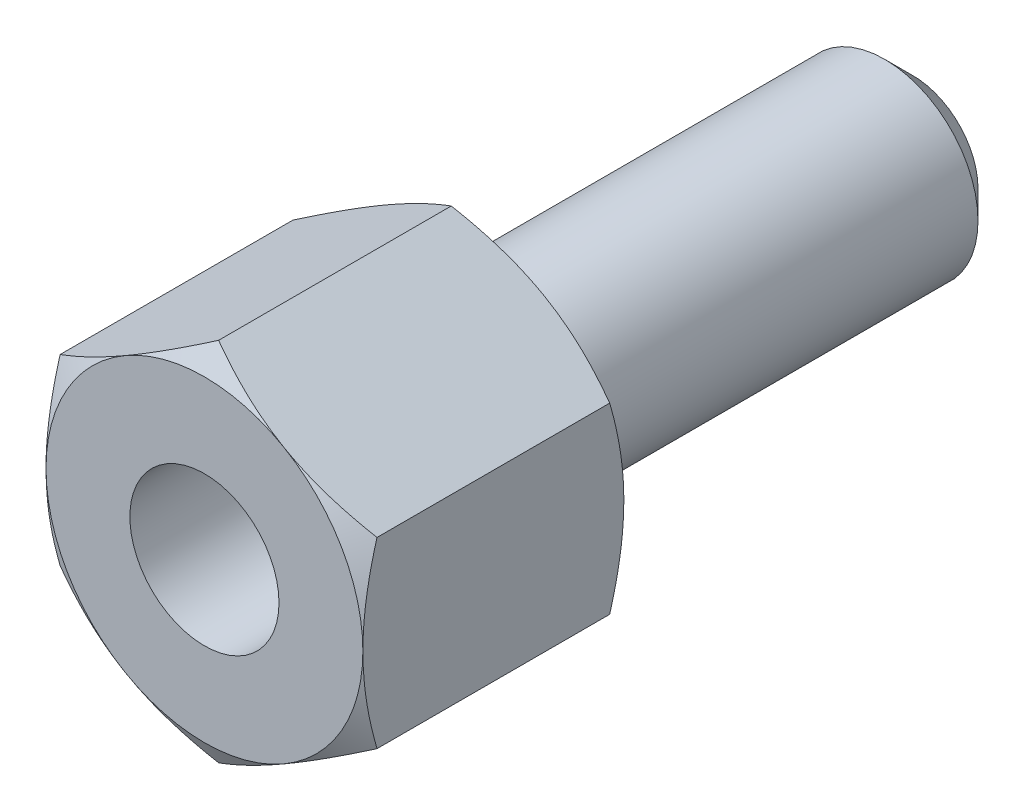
ISO-10303-21;
HEADER;
FILE_DESCRIPTION(('STEP AP214'),'2;1');
FILE_NAME('part.step','',(''),(''),'','','');
FILE_SCHEMA(('AUTOMOTIVE_DESIGN { 1 0 10303 214 1 1 1 1 }'));
ENDSEC;
DATA;
#1=APPLICATION_CONTEXT('core data for automotive mechanical design processes');
#2=APPLICATION_PROTOCOL_DEFINITION('international standard','automotive_design',2000,#1);
#3=PRODUCT_CONTEXT('',#1,'mechanical');
#4=PRODUCT('Part','Part','',(#3));
#5=PRODUCT_RELATED_PRODUCT_CATEGORY('part','',(#4));
#6=PRODUCT_DEFINITION_FORMATION('','',#4);
#7=PRODUCT_DEFINITION_CONTEXT('part definition',#1,'design');
#8=PRODUCT_DEFINITION('design','',#6,#7);
#9=PRODUCT_DEFINITION_SHAPE('','',#8);
#10=(LENGTH_UNIT() NAMED_UNIT(*) SI_UNIT(.MILLI.,.METRE.));
#11=(NAMED_UNIT(*) PLANE_ANGLE_UNIT() SI_UNIT($,.RADIAN.));
#12=(NAMED_UNIT(*) SI_UNIT($,.STERADIAN.) SOLID_ANGLE_UNIT());
#13=UNCERTAINTY_MEASURE_WITH_UNIT(LENGTH_MEASURE(1.E-05),#10,'distance_accuracy_value','');
#14=(GEOMETRIC_REPRESENTATION_CONTEXT(3) GLOBAL_UNCERTAINTY_ASSIGNED_CONTEXT((#13)) GLOBAL_UNIT_ASSIGNED_CONTEXT((#10,
#11,#12)) REPRESENTATION_CONTEXT('',''));
#15=CARTESIAN_POINT('',(0.,0.,0.));
#16=DIRECTION('',(0.,0.,1.));
#17=DIRECTION('',(1.,0.,0.));
#18=AXIS2_PLACEMENT_3D('',#15,#16,#17);
#19=CARTESIAN_POINT('',(8.5,4.90747728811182,14.));
#20=DIRECTION('',(-0.5,-0.866025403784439,0.));
#21=DIRECTION('',(0.866025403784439,-0.5,0.));
#22=AXIS2_PLACEMENT_3D('',#19,#20,#21);
#23=PLANE('',#22);
#24=DIRECTION('',(0.,0.,-1.));
#25=VECTOR('',#24,1.);
#26=CARTESIAN_POINT('',(8.5,4.90747728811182,14.));
#27=LINE('',#26,#25);
#28=CARTESIAN_POINT('',(8.5,4.90747728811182,13.2408106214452));
#29=VERTEX_POINT('',#28);
#30=CARTESIAN_POINT('',(8.5,4.90747728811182,0.75918937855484));
#31=VERTEX_POINT('',#30);
#32=EDGE_CURVE('E337',#29,#31,#27,.T.);
#33=ORIENTED_EDGE('',*,*,#32,.T.);
#34=CARTESIAN_POINT('',(8.5002,4.90736181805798,0.759256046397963));
#35=CARTESIAN_POINT('',(8.31336077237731,5.01523349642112,0.696986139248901));
#36=CARTESIAN_POINT('',(8.12582494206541,5.1235073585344,0.63754229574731));
#37=CARTESIAN_POINT('',(7.74923024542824,5.34093440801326,0.525085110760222));
#38=CARTESIAN_POINT('',(7.56017075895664,5.45008795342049,0.472074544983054));
#39=CARTESIAN_POINT('',(6.9899652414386,5.77929626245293,0.323733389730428));
#40=CARTESIAN_POINT('',(6.60656835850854,6.00065055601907,0.239358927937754));
#41=CARTESIAN_POINT('',(6.03282233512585,6.33190297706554,0.140420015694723));
#42=CARTESIAN_POINT('',(5.84418723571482,6.44081150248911,0.112235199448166));
#43=CARTESIAN_POINT('',(5.4660639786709,6.65912106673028,0.0649740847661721));
#44=CARTESIAN_POINT('',(5.27657589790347,6.76852206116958,0.0458969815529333));
#45=CARTESIAN_POINT('',(4.8972734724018,6.98751241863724,0.0173347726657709));
#46=CARTESIAN_POINT('',(4.70745974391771,7.09710142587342,0.0078387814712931));
#47=CARTESIAN_POINT('',(4.32765694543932,7.31638067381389,-0.00135762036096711));
#48=CARTESIAN_POINT('',(4.13766788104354,7.42607091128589,-0.00105833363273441));
#49=CARTESIAN_POINT('',(3.78247698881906,7.63114046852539,0.00865447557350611));
#50=CARTESIAN_POINT('',(3.6172500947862,7.72653426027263,0.0168831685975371));
#51=CARTESIAN_POINT('',(3.28718328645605,7.9170984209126,0.0405892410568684));
#52=CARTESIAN_POINT('',(3.12234339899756,8.01226877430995,0.0560671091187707));
#53=CARTESIAN_POINT('',(2.62846189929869,8.29741139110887,0.113008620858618));
#54=CARTESIAN_POINT('',(2.30029449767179,8.48687892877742,0.164973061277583));
#55=CARTESIAN_POINT('',(1.64047857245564,8.86782383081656,0.294884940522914));
#56=CARTESIAN_POINT('',(1.30891425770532,9.05925257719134,0.373383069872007));
#57=CARTESIAN_POINT('',(0.650730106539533,9.43925537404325,0.551541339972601));
#58=CARTESIAN_POINT('',(0.324101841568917,9.62783429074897,0.651159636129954));
#59=CARTESIAN_POINT('',(-0.00020000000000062,9.81507004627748,0.759256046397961));
#60=B_SPLINE_CURVE_WITH_KNOTS('',3,(#34,#35,#36,#37,#38,#39,#40,#41,#42,#43,#44,#45,#46,#47,#48,
#49,#50,#51,#52,#53,#54,#55,#56,#57,#58,#59),.UNSPECIFIED.,.F.,.F.,(4,2,2,2,2,2,2,2,2,2,2,2,4),
(0.,0.67359639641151,1.34748239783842,2.69805431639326,3.356799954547,4.01548737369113,
4.67342558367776,5.33134346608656,5.9040955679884,6.47688628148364,7.62328361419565,
8.79510569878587,9.96462743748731),.UNSPECIFIED.);
#61=CARTESIAN_POINT('',(4.25,7.36121593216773,0.));
#62=VERTEX_POINT('',#61);
#63=EDGE_CURVE('E145',#31,#62,#60,.T.);
#64=ORIENTED_EDGE('',*,*,#63,.T.);
#65=CARTESIAN_POINT('',(0.,9.81495457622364,0.75918937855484));
#66=VERTEX_POINT('',#65);
#67=EDGE_CURVE('E114',#62,#66,#60,.T.);
#68=ORIENTED_EDGE('',*,*,#67,.T.);
#69=DIRECTION('',(0.,0.,-1.));
#70=VECTOR('',#69,1.);
#71=CARTESIAN_POINT('',(0.,9.81495457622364,14.));
#72=LINE('',#71,#70);
#73=CARTESIAN_POINT('',(0.,9.81495457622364,13.2408106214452));
#74=VERTEX_POINT('',#73);
#75=EDGE_CURVE('E135',#74,#66,#72,.T.);
#76=ORIENTED_EDGE('',*,*,#75,.F.);
#77=CARTESIAN_POINT('',(-0.000200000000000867,9.81507004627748,13.240743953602));
#78=CARTESIAN_POINT('',(0.186639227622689,9.70719836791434,13.3030138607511));
#79=CARTESIAN_POINT('',(0.374175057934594,9.59892450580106,13.3624577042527));
#80=CARTESIAN_POINT('',(0.75076975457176,9.3814974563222,13.4749148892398));
#81=CARTESIAN_POINT('',(0.939829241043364,9.27234391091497,13.5279254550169));
#82=CARTESIAN_POINT('',(1.51003475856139,8.94313560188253,13.6762666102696));
#83=CARTESIAN_POINT('',(1.89343164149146,8.72178130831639,13.7606410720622));
#84=CARTESIAN_POINT('',(2.46717766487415,8.39052888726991,13.8595799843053));
#85=CARTESIAN_POINT('',(2.65581276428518,8.28162036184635,13.8877648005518));
#86=CARTESIAN_POINT('',(3.0339360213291,8.06331079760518,13.9350259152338));
#87=CARTESIAN_POINT('',(3.22342410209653,7.95390980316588,13.954103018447));
#88=CARTESIAN_POINT('',(3.60272652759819,7.73491944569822,13.9826652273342));
#89=CARTESIAN_POINT('',(3.79254025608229,7.62533043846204,13.9921612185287));
#90=CARTESIAN_POINT('',(4.17234305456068,7.40605119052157,14.0013576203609));
#91=CARTESIAN_POINT('',(4.36233211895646,7.29636095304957,14.0010583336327));
#92=CARTESIAN_POINT('',(4.71752301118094,7.09129139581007,13.9913455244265));
#93=CARTESIAN_POINT('',(4.88274990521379,6.99589760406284,13.9831168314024));
#94=CARTESIAN_POINT('',(5.21281671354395,6.80533344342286,13.9594107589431));
#95=CARTESIAN_POINT('',(5.37765660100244,6.71016309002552,13.9439328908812));
#96=CARTESIAN_POINT('',(5.87153810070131,6.42502047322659,13.8869913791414));
#97=CARTESIAN_POINT('',(6.19970550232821,6.23555293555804,13.8350269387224));
#98=CARTESIAN_POINT('',(6.85952142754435,5.8546080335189,13.7051150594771));
#99=CARTESIAN_POINT('',(7.19108574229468,5.66317928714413,13.626616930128));
#100=CARTESIAN_POINT('',(7.84926989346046,5.28317649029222,13.4484586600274));
#101=CARTESIAN_POINT('',(8.17589815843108,5.09459757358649,13.34884036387));
#102=CARTESIAN_POINT('',(8.5002,4.90736181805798,13.240743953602));
#103=B_SPLINE_CURVE_WITH_KNOTS('',3,(#77,#78,#79,#80,#81,#82,#83,#84,#85,#86,#87,#88,#89,#90,
#91,#92,#93,#94,#95,#96,#97,#98,#99,#100,#101,#102),.UNSPECIFIED.,.F.,.F.,(4,2,2,2,2,2,2,2,2,2,
2,2,4),(0.,0.673596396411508,1.34748239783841,2.69805431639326,3.35679995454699,
4.01548737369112,4.67342558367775,5.33134346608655,5.90409556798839,6.47688628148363,
7.62328361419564,8.79510569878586,9.9646274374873),.UNSPECIFIED.);
#104=CARTESIAN_POINT('',(4.25,7.36121593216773,14.));
#105=VERTEX_POINT('',#104);
#106=EDGE_CURVE('E341',#74,#105,#103,.T.);
#107=ORIENTED_EDGE('',*,*,#106,.T.);
#108=EDGE_CURVE('E255',#105,#29,#103,.T.);
#109=ORIENTED_EDGE('',*,*,#108,.T.);
#110=EDGE_LOOP('',(#33,#64,#68,#76,#107,#109));
#111=FACE_BOUND('',#110,.T.);
#112=ADVANCED_FACE('F14',(#111),#23,.F.);
#113=CARTESIAN_POINT('',(8.5,-4.90747728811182,14.));
#114=DIRECTION('',(-1.,0.,0.));
#115=DIRECTION('',(0.,-1.,0.));
#116=AXIS2_PLACEMENT_3D('',#113,#114,#115);
#117=PLANE('',#116);
#118=DIRECTION('',(0.,0.,-1.));
#119=VECTOR('',#118,1.);
#120=CARTESIAN_POINT('',(8.5,-4.90747728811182,14.));
#121=LINE('',#120,#119);
#122=CARTESIAN_POINT('',(8.5,-4.90747728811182,13.2408106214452));
#123=VERTEX_POINT('',#122);
#124=CARTESIAN_POINT('',(8.5,-4.9074772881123,0.759189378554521));
#125=VERTEX_POINT('',#124);
#126=EDGE_CURVE('E333',#123,#125,#121,.T.);
#127=ORIENTED_EDGE('',*,*,#126,.T.);
#128=CARTESIAN_POINT('',(8.5,-13.354135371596,4.23186863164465));
#129=CARTESIAN_POINT('',(8.5,-12.9814159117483,4.05038124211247));
#130=CARTESIAN_POINT('',(8.5,-12.6078591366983,3.87058490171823));
#131=CARTESIAN_POINT('',(8.5,-11.8586263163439,3.51532203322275));
#132=CARTESIAN_POINT('',(8.5,-11.4829499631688,3.33985615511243));
#133=CARTESIAN_POINT('',(8.5,-10.7271788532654,2.99335554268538));
#134=CARTESIAN_POINT('',(8.5,-10.3470712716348,2.82234868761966));
#135=CARTESIAN_POINT('',(8.5,-9.58389266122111,2.48710662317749));
#136=CARTESIAN_POINT('',(8.5,-9.2008217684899,2.32287110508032));
#137=CARTESIAN_POINT('',(8.5,-8.41807876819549,1.99753861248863));
#138=CARTESIAN_POINT('',(8.5,-8.01828363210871,1.836736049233));
#139=CARTESIAN_POINT('',(8.5,-7.21408086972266,1.52688957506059));
#140=CARTESIAN_POINT('',(8.5,-6.80967274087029,1.37784695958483));
#141=CARTESIAN_POINT('',(8.5,-5.99629875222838,1.09530796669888));
#142=CARTESIAN_POINT('',(8.5,-5.58734344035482,0.961781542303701));
#143=CARTESIAN_POINT('',(8.5,-4.76358283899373,0.714444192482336));
#144=CARTESIAN_POINT('',(8.5,-4.34877938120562,0.600627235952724));
#145=CARTESIAN_POINT('',(8.5,-3.51536652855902,0.398680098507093));
#146=CARTESIAN_POINT('',(8.5,-3.09679350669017,0.310403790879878));
#147=CARTESIAN_POINT('',(8.5,-2.46498813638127,0.200873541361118));
#148=CARTESIAN_POINT('',(8.5,-2.25371438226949,0.168176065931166));
#149=CARTESIAN_POINT('',(8.5,-1.8300592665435,0.111046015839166));
#150=CARTESIAN_POINT('',(8.5,-1.61767801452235,0.0866126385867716));
#151=CARTESIAN_POINT('',(8.5,-1.19494146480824,0.046813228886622));
#152=CARTESIAN_POINT('',(8.5,-0.984597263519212,0.0313298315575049));
#153=CARTESIAN_POINT('',(8.5,-0.563441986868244,0.00927959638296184));
#154=CARTESIAN_POINT('',(8.5,-0.352630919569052,0.00271260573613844));
#155=CARTESIAN_POINT('',(8.5,0.0690799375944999,-0.00134741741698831));
#156=CARTESIAN_POINT('',(8.5,0.279979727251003,0.00115952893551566));
#157=CARTESIAN_POINT('',(8.5,0.70148193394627,0.0151839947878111));
#158=CARTESIAN_POINT('',(8.5,0.912084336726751,0.0267019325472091));
#159=CARTESIAN_POINT('',(8.5,1.41311116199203,0.0645741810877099));
#160=CARTESIAN_POINT('',(8.5,1.70324077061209,0.0949193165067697));
#161=CARTESIAN_POINT('',(8.5,2.28144455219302,0.171093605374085));
#162=CARTESIAN_POINT('',(8.5,2.56951845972,0.216924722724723));
#163=CARTESIAN_POINT('',(8.5,3.43027331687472,0.3752251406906));
#164=CARTESIAN_POINT('',(8.5,3.99918848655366,0.50847582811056));
#165=CARTESIAN_POINT('',(8.5,4.85008763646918,0.740793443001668));
#166=CARTESIAN_POINT('',(8.5,5.13645147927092,0.82475247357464));
#167=CARTESIAN_POINT('',(8.5,5.70640137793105,1.00170549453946));
#168=CARTESIAN_POINT('',(8.5,5.98998741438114,1.09469954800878));
#169=CARTESIAN_POINT('',(8.5,6.55446466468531,1.28820467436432));
#170=CARTESIAN_POINT('',(8.5,6.83535665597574,1.38871350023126));
#171=CARTESIAN_POINT('',(8.5,7.39479262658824,1.59603437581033));
#172=CARTESIAN_POINT('',(8.5,7.67333664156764,1.70284632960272));
#173=CARTESIAN_POINT('',(8.5,8.36027381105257,1.97376772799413));
#174=CARTESIAN_POINT('',(8.5,8.76744306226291,2.14097575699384));
#175=CARTESIAN_POINT('',(8.5,9.57804082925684,2.48425409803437));
#176=CARTESIAN_POINT('',(8.5,9.9814690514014,2.66032509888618));
#177=CARTESIAN_POINT('',(8.5,10.7853317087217,3.01945076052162));
#178=CARTESIAN_POINT('',(8.5,11.1857652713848,3.20250736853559));
#179=CARTESIAN_POINT('',(8.5,11.9840570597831,3.57410887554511));
#180=CARTESIAN_POINT('',(8.5,12.3819153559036,3.76265362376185));
#181=CARTESIAN_POINT('',(8.5,13.1760223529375,4.14439488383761));
#182=CARTESIAN_POINT('',(8.5,13.5722683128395,4.33759708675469));
#183=CARTESIAN_POINT('',(8.5,14.3629923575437,4.72758594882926));
#184=CARTESIAN_POINT('',(8.5,14.7574704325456,4.92437262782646));
#185=CARTESIAN_POINT('',(8.5,15.5448812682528,5.32085324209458));
#186=CARTESIAN_POINT('',(8.5,15.9378142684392,5.52054670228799));
#187=CARTESIAN_POINT('',(8.5,16.7224316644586,5.92237306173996));
#188=CARTESIAN_POINT('',(8.5,17.114116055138,6.12450597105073));
#189=CARTESIAN_POINT('',(8.5,18.2161605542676,6.69685707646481));
#190=CARTESIAN_POINT('',(8.49999999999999,18.9253055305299,7.06941476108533));
#191=CARTESIAN_POINT('',(8.49999999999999,20.340999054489,7.81949456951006));
#192=CARTESIAN_POINT('',(8.49999999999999,21.0475474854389,8.19701691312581));
#193=CARTESIAN_POINT('',(8.49999999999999,22.4565996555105,8.95474143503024));
#194=CARTESIAN_POINT('',(8.49999999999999,23.1591091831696,9.33493285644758));
#195=CARTESIAN_POINT('',(8.49999999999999,24.2116631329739,9.90738965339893));
#196=CARTESIAN_POINT('',(8.49999999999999,24.562301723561,10.0985641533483));
#197=CARTESIAN_POINT('',(8.49999999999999,25.2632232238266,10.4815627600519));
#198=CARTESIAN_POINT('',(8.5,25.6135061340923,10.6733868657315));
#199=CARTESIAN_POINT('',(8.5,25.9636319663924,10.8654973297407));
#200=B_SPLINE_CURVE_WITH_KNOTS('',3,(#128,#129,#130,#131,#132,#133,#134,#135,#136,#137,#138,
#139,#140,#141,#142,#143,#144,#145,#146,#147,#148,#149,#150,#151,#152,#153,#154,#155,#156,#157,
#158,#159,#160,#161,#162,#163,#164,#165,#166,#167,#168,#169,#170,#171,#172,#173,#174,#175,#176,
#177,#178,#179,#180,#181,#182,#183,#184,#185,#186,#187,#188,#189,#190,#191,#192,#193,#194,#195,
#196,#197,#198,#199),.UNSPECIFIED.,.F.,.F.,(4,2,2,2,2,2,2,2,2,2,2,2,2,2,2,2,2,2,2,2,2,2,2,2,2,2,
2,2,2,2,2,2,2,2,2,4),(0.,1.24368523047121,2.48755601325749,3.73791334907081,4.98821361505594,
6.28083538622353,7.57359935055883,8.8638166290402,10.1536384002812,11.4359277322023,
12.0771585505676,12.7183270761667,13.3508849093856,13.9834319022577,14.6159774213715,
15.2485523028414,16.1231982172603,16.9979550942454,18.7483648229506,19.6435398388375,
20.5387211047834,21.4336357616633,22.3285368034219,23.6488857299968,24.9693374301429,
26.2901599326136,27.6109461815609,28.9334375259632,30.255936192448,31.5782210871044,
32.9005114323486,35.3036401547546,37.7068756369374,40.1032356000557,41.3013402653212,
42.4994429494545),.UNSPECIFIED.);
#201=CARTESIAN_POINT('',(8.5,0.,0.));
#202=VERTEX_POINT('',#201);
#203=EDGE_CURVE('E151',#125,#202,#200,.T.);
#204=ORIENTED_EDGE('',*,*,#203,.T.);
#205=EDGE_CURVE('E147',#202,#31,#200,.T.);
#206=ORIENTED_EDGE('',*,*,#205,.T.);
#207=ORIENTED_EDGE('',*,*,#32,.F.);
#208=CARTESIAN_POINT('',(8.5,-13.354135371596,9.76813136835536));
#209=CARTESIAN_POINT('',(8.5,-12.9814159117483,9.94961875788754));
#210=CARTESIAN_POINT('',(8.5,-12.6078591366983,10.1294150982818));
#211=CARTESIAN_POINT('',(8.5,-11.8586263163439,10.4846779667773));
#212=CARTESIAN_POINT('',(8.5,-11.4829499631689,10.6601438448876));
#213=CARTESIAN_POINT('',(8.5,-10.7271788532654,11.0066444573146));
#214=CARTESIAN_POINT('',(8.5,-10.3470712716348,11.1776513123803));
#215=CARTESIAN_POINT('',(8.5,-9.58389266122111,11.5128933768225));
#216=CARTESIAN_POINT('',(8.5,-9.20082176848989,11.6771288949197));
#217=CARTESIAN_POINT('',(8.5,-8.41807876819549,12.0024613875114));
#218=CARTESIAN_POINT('',(8.5,-8.0182836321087,12.163263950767));
#219=CARTESIAN_POINT('',(8.5,-7.21408086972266,12.4731104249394));
#220=CARTESIAN_POINT('',(8.5,-6.80967274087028,12.6221530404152));
#221=CARTESIAN_POINT('',(8.5,-5.99629875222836,12.9046920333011));
#222=CARTESIAN_POINT('',(8.5,-5.5873434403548,13.0382184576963));
#223=CARTESIAN_POINT('',(8.5,-4.76358283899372,13.2855558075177));
#224=CARTESIAN_POINT('',(8.5,-4.34877938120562,13.3993727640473));
#225=CARTESIAN_POINT('',(8.5,-3.51536652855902,13.6013199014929));
#226=CARTESIAN_POINT('',(8.5,-3.09679350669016,13.6895962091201));
#227=CARTESIAN_POINT('',(8.5,-2.46498813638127,13.7991264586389));
#228=CARTESIAN_POINT('',(8.5,-2.25371438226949,13.8318239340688));
#229=CARTESIAN_POINT('',(8.5,-1.8300592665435,13.8889539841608));
#230=CARTESIAN_POINT('',(8.5,-1.61767801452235,13.9133873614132));
#231=CARTESIAN_POINT('',(8.5,-1.19494146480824,13.9531867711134));
#232=CARTESIAN_POINT('',(8.5,-0.984597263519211,13.9686701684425));
#233=CARTESIAN_POINT('',(8.5,-0.563441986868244,13.990720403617));
#234=CARTESIAN_POINT('',(8.5,-0.352630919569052,13.9972873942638));
#235=CARTESIAN_POINT('',(8.5,0.0690799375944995,14.001347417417));
#236=CARTESIAN_POINT('',(8.5,0.279979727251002,13.9988404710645));
#237=CARTESIAN_POINT('',(8.5,0.701481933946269,13.9848160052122));
#238=CARTESIAN_POINT('',(8.5,0.91208433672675,13.9732980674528));
#239=CARTESIAN_POINT('',(8.5,1.41311116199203,13.9354258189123));
#240=CARTESIAN_POINT('',(8.5,1.70324077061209,13.9050806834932));
#241=CARTESIAN_POINT('',(8.5,2.28144455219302,13.8289063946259));
#242=CARTESIAN_POINT('',(8.5,2.56951845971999,13.7830752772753));
#243=CARTESIAN_POINT('',(8.5,3.43027331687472,13.6247748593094));
#244=CARTESIAN_POINT('',(8.5,3.99918848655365,13.4915241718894));
#245=CARTESIAN_POINT('',(8.5,4.85008763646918,13.2592065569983));
#246=CARTESIAN_POINT('',(8.5,5.13645147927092,13.1752475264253));
#247=CARTESIAN_POINT('',(8.5,5.70640137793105,12.9982945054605));
#248=CARTESIAN_POINT('',(8.5,5.98998741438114,12.9053004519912));
#249=CARTESIAN_POINT('',(8.5,6.55446466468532,12.7117953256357));
#250=CARTESIAN_POINT('',(8.5,6.83535665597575,12.6112864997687));
#251=CARTESIAN_POINT('',(8.5,7.39479262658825,12.4039656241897));
#252=CARTESIAN_POINT('',(8.5,7.67333664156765,12.2971536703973));
#253=CARTESIAN_POINT('',(8.5,8.36027381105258,12.0262322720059));
#254=CARTESIAN_POINT('',(8.5,8.76744306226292,11.8590242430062));
#255=CARTESIAN_POINT('',(8.5,9.57804082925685,11.5157459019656));
#256=CARTESIAN_POINT('',(8.5,9.98146905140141,11.3396749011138));
#257=CARTESIAN_POINT('',(8.5,10.7853317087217,10.9805492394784));
#258=CARTESIAN_POINT('',(8.5,11.1857652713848,10.7974926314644));
#259=CARTESIAN_POINT('',(8.5,11.9840570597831,10.4258911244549));
#260=CARTESIAN_POINT('',(8.5,12.3819153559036,10.2373463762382));
#261=CARTESIAN_POINT('',(8.5,13.1760223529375,9.85560511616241));
#262=CARTESIAN_POINT('',(8.5,13.5722683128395,9.66240291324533));
#263=CARTESIAN_POINT('',(8.5,14.3629923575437,9.27241405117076));
#264=CARTESIAN_POINT('',(8.5,14.7574704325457,9.07562737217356));
#265=CARTESIAN_POINT('',(8.5,15.5448812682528,8.67914675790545));
#266=CARTESIAN_POINT('',(8.5,15.9378142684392,8.47945329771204));
#267=CARTESIAN_POINT('',(8.5,16.7224316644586,8.07762693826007));
#268=CARTESIAN_POINT('',(8.5,17.114116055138,7.87549402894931));
#269=CARTESIAN_POINT('',(8.5,18.2161605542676,7.30314292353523));
#270=CARTESIAN_POINT('',(8.49999999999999,18.92530553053,6.93058523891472));
#271=CARTESIAN_POINT('',(8.49999999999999,20.340999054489,6.18050543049));
#272=CARTESIAN_POINT('',(8.49999999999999,21.0475474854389,5.80298308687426));
#273=CARTESIAN_POINT('',(8.49999999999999,22.4565996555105,5.04525856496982));
#274=CARTESIAN_POINT('',(8.49999999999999,23.1591091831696,4.66506714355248));
#275=CARTESIAN_POINT('',(8.49999999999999,24.2116631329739,4.09261034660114));
#276=CARTESIAN_POINT('',(8.49999999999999,24.562301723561,3.90143584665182));
#277=CARTESIAN_POINT('',(8.49999999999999,25.2632232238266,3.51843723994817));
#278=CARTESIAN_POINT('',(8.5,25.6135061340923,3.32661313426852));
#279=CARTESIAN_POINT('',(8.5,25.9636319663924,3.13450267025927));
#280=B_SPLINE_CURVE_WITH_KNOTS('',3,(#208,#209,#210,#211,#212,#213,#214,#215,#216,#217,#218,
#219,#220,#221,#222,#223,#224,#225,#226,#227,#228,#229,#230,#231,#232,#233,#234,#235,#236,#237,
#238,#239,#240,#241,#242,#243,#244,#245,#246,#247,#248,#249,#250,#251,#252,#253,#254,#255,#256,
#257,#258,#259,#260,#261,#262,#263,#264,#265,#266,#267,#268,#269,#270,#271,#272,#273,#274,#275,
#276,#277,#278,#279),.UNSPECIFIED.,.F.,.F.,(4,2,2,2,2,2,2,2,2,2,2,2,2,2,2,2,2,2,2,2,2,2,2,2,2,2,
2,2,2,2,2,2,2,2,2,4),(0.,1.24368523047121,2.48755601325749,3.73791334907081,4.98821361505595,
6.28083538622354,7.57359935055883,8.8638166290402,10.1536384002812,11.4359277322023,
12.0771585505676,12.7183270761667,13.3508849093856,13.9834319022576,14.6159774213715,
15.2485523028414,16.1231982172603,16.9979550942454,18.7483648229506,19.6435398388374,
20.5387211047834,21.4336357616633,22.3285368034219,23.6488857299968,24.9693374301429,
26.2901599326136,27.6109461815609,28.9334375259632,30.255936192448,31.5782210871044,
32.9005114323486,35.3036401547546,37.7068756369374,40.1032356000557,41.3013402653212,
42.4994429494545),.UNSPECIFIED.);
#281=CARTESIAN_POINT('',(8.5,0.,14.));
#282=VERTEX_POINT('',#281);
#283=EDGE_CURVE('E254',#29,#282,#280,.F.);
#284=ORIENTED_EDGE('',*,*,#283,.T.);
#285=EDGE_CURVE('E247',#282,#123,#280,.F.);
#286=ORIENTED_EDGE('',*,*,#285,.T.);
#287=EDGE_LOOP('',(#127,#204,#206,#207,#284,#286));
#288=FACE_BOUND('',#287,.T.);
#289=ADVANCED_FACE('F261',(#288),#117,.F.);
#290=CARTESIAN_POINT('',(0.,-9.81495457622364,14.));
#291=DIRECTION('',(-0.5,0.866025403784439,0.));
#292=DIRECTION('',(-0.866025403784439,-0.5,0.));
#293=AXIS2_PLACEMENT_3D('',#290,#291,#292);
#294=PLANE('',#293);
#295=DIRECTION('',(0.,0.,-1.));
#296=VECTOR('',#295,1.);
#297=CARTESIAN_POINT('',(0.,-9.81495457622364,14.));
#298=LINE('',#297,#296);
#299=CARTESIAN_POINT('',(0.,-9.81495457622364,13.2408106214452));
#300=VERTEX_POINT('',#299);
#301=CARTESIAN_POINT('',(0.,-9.81495457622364,0.759189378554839));
#302=VERTEX_POINT('',#301);
#303=EDGE_CURVE('E169',#300,#302,#298,.T.);
#304=ORIENTED_EDGE('',*,*,#303,.T.);
#305=CARTESIAN_POINT('',(-0.000200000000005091,-9.81507004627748,0.759256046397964));
#306=CARTESIAN_POINT('',(0.186639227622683,-9.70719836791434,0.696986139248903));
#307=CARTESIAN_POINT('',(0.374175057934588,-9.59892450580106,0.637542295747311));
#308=CARTESIAN_POINT('',(0.750769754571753,-9.38149745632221,0.525085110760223));
#309=CARTESIAN_POINT('',(0.939829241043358,-9.27234391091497,0.472074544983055));
#310=CARTESIAN_POINT('',(1.51003475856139,-8.94313560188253,0.323733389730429));
#311=CARTESIAN_POINT('',(1.89343164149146,-8.72178130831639,0.239358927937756));
#312=CARTESIAN_POINT('',(2.46717766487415,-8.39052888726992,0.140420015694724));
#313=CARTESIAN_POINT('',(2.65581276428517,-8.28162036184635,0.112235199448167));
#314=CARTESIAN_POINT('',(3.0339360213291,-8.06331079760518,0.0649740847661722));
#315=CARTESIAN_POINT('',(3.22342410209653,-7.95390980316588,0.0458969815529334));
#316=CARTESIAN_POINT('',(3.60272652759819,-7.73491944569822,0.0173347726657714));
#317=CARTESIAN_POINT('',(3.79254025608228,-7.62533043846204,0.00783878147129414));
#318=CARTESIAN_POINT('',(4.17234305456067,-7.40605119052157,-0.00135762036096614));
#319=CARTESIAN_POINT('',(4.36233211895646,-7.29636095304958,-0.00105833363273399));
#320=CARTESIAN_POINT('',(4.71752301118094,-7.09129139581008,0.00865447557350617));
#321=CARTESIAN_POINT('',(4.88274990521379,-6.99589760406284,0.0168831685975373));
#322=CARTESIAN_POINT('',(5.21281671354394,-6.80533344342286,0.0405892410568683));
#323=CARTESIAN_POINT('',(5.37765660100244,-6.71016309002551,0.0560671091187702));
#324=CARTESIAN_POINT('',(5.87153810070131,-6.4250204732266,0.113008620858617));
#325=CARTESIAN_POINT('',(6.19970550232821,-6.23555293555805,0.164973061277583));
#326=CARTESIAN_POINT('',(6.85952142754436,-5.8546080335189,0.294884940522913));
#327=CARTESIAN_POINT('',(7.19108574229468,-5.66317928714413,0.373383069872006));
#328=CARTESIAN_POINT('',(7.84926989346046,-5.28317649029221,0.5515413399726));
#329=CARTESIAN_POINT('',(8.17589815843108,-5.09459757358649,0.651159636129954));
#330=CARTESIAN_POINT('',(8.5002,-4.90736181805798,0.759256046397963));
#331=B_SPLINE_CURVE_WITH_KNOTS('',3,(#305,#306,#307,#308,#309,#310,#311,#312,#313,#314,#315,
#316,#317,#318,#319,#320,#321,#322,#323,#324,#325,#326,#327,#328,#329,#330),.UNSPECIFIED.,.F.,
.F.,(4,2,2,2,2,2,2,2,2,2,2,2,4),(0.,0.67359639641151,1.34748239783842,2.69805431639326,
3.356799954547,4.01548737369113,4.67342558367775,5.33134346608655,5.9040955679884,
6.47688628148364,7.62328361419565,8.79510569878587,9.96462743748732),.UNSPECIFIED.);
#332=CARTESIAN_POINT('',(4.25,-7.36121593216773,0.));
#333=VERTEX_POINT('',#332);
#334=EDGE_CURVE('E162',#302,#333,#331,.T.);
#335=ORIENTED_EDGE('',*,*,#334,.T.);
#336=EDGE_CURVE('E157',#333,#125,#331,.T.);
#337=ORIENTED_EDGE('',*,*,#336,.T.);
#338=ORIENTED_EDGE('',*,*,#126,.F.);
#339=CARTESIAN_POINT('',(8.5002,-4.90736181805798,13.240743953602));
#340=CARTESIAN_POINT('',(8.31336077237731,-5.01523349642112,13.3030138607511));
#341=CARTESIAN_POINT('',(8.1258249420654,-5.1235073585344,13.3624577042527));
#342=CARTESIAN_POINT('',(7.74923024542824,-5.34093440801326,13.4749148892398));
#343=CARTESIAN_POINT('',(7.56017075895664,-5.45008795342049,13.5279254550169));
#344=CARTESIAN_POINT('',(6.98996524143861,-5.77929626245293,13.6762666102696));
#345=CARTESIAN_POINT('',(6.60656835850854,-6.00065055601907,13.7606410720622));
#346=CARTESIAN_POINT('',(6.03282233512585,-6.33190297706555,13.8595799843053));
#347=CARTESIAN_POINT('',(5.84418723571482,-6.44081150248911,13.8877648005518));
#348=CARTESIAN_POINT('',(5.4660639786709,-6.65912106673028,13.9350259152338));
#349=CARTESIAN_POINT('',(5.27657589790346,-6.76852206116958,13.954103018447));
#350=CARTESIAN_POINT('',(4.8972734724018,-6.98751241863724,13.9826652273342));
#351=CARTESIAN_POINT('',(4.70745974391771,-7.09710142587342,13.9921612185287));
#352=CARTESIAN_POINT('',(4.32765694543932,-7.31638067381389,14.0013576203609));
#353=CARTESIAN_POINT('',(4.13766788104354,-7.42607091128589,14.0010583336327));
#354=CARTESIAN_POINT('',(3.78247698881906,-7.63114046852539,13.9913455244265));
#355=CARTESIAN_POINT('',(3.61725009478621,-7.72653426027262,13.9831168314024));
#356=CARTESIAN_POINT('',(3.28718328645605,-7.9170984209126,13.9594107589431));
#357=CARTESIAN_POINT('',(3.12234339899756,-8.01226877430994,13.9439328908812));
#358=CARTESIAN_POINT('',(2.62846189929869,-8.29741139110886,13.8869913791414));
#359=CARTESIAN_POINT('',(2.30029449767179,-8.48687892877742,13.8350269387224));
#360=CARTESIAN_POINT('',(1.64047857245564,-8.86782383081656,13.7051150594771));
#361=CARTESIAN_POINT('',(1.30891425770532,-9.05925257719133,13.626616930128));
#362=CARTESIAN_POINT('',(0.650730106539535,-9.43925537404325,13.4484586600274));
#363=CARTESIAN_POINT('',(0.324101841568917,-9.62783429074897,13.34884036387));
#364=CARTESIAN_POINT('',(-0.000200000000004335,-9.81507004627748,13.240743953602));
#365=B_SPLINE_CURVE_WITH_KNOTS('',3,(#339,#340,#341,#342,#343,#344,#345,#346,#347,#348,#349,
#350,#351,#352,#353,#354,#355,#356,#357,#358,#359,#360,#361,#362,#363,#364),.UNSPECIFIED.,.F.,
.F.,(4,2,2,2,2,2,2,2,2,2,2,2,4),(0.,0.673596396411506,1.34748239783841,2.69805431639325,
3.35679995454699,4.01548737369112,4.67342558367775,5.33134346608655,5.90409556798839,
6.47688628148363,7.62328361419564,8.79510569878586,9.9646274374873),.UNSPECIFIED.);
#366=CARTESIAN_POINT('',(4.25,-7.36121593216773,14.));
#367=VERTEX_POINT('',#366);
#368=EDGE_CURVE('E246',#123,#367,#365,.T.);
#369=ORIENTED_EDGE('',*,*,#368,.T.);
#370=EDGE_CURVE('E240',#367,#300,#365,.T.);
#371=ORIENTED_EDGE('',*,*,#370,.T.);
#372=EDGE_LOOP('',(#304,#335,#337,#338,#369,#371));
#373=FACE_BOUND('',#372,.T.);
#374=ADVANCED_FACE('F166',(#373),#294,.F.);
#375=CARTESIAN_POINT('',(-8.5,-4.90747728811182,14.));
#376=DIRECTION('',(0.5,0.866025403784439,0.));
#377=DIRECTION('',(-0.866025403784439,0.5,0.));
#378=AXIS2_PLACEMENT_3D('',#375,#376,#377);
#379=PLANE('',#378);
#380=DIRECTION('',(0.,0.,-1.));
#381=VECTOR('',#380,1.);
#382=CARTESIAN_POINT('',(-8.5,-4.90747728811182,14.));
#383=LINE('',#382,#381);
#384=CARTESIAN_POINT('',(-8.5,-4.9074772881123,13.2408106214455));
#385=VERTEX_POINT('',#384);
#386=CARTESIAN_POINT('',(-8.5,-4.9074772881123,0.759189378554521));
#387=VERTEX_POINT('',#386);
#388=EDGE_CURVE('E319',#385,#387,#383,.T.);
#389=ORIENTED_EDGE('',*,*,#388,.T.);
#390=CARTESIAN_POINT('',(-8.5002,-4.90736181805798,0.759256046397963));
#391=CARTESIAN_POINT('',(-8.31336077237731,-5.01523349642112,0.696986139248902));
#392=CARTESIAN_POINT('',(-8.12582494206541,-5.1235073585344,0.63754229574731));
#393=CARTESIAN_POINT('',(-7.74923024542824,-5.34093440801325,0.525085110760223));
#394=CARTESIAN_POINT('',(-7.56017075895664,-5.45008795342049,0.472074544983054));
#395=CARTESIAN_POINT('',(-6.98996524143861,-5.77929626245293,0.323733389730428));
#396=CARTESIAN_POINT('',(-6.60656835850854,-6.00065055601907,0.239358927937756));
#397=CARTESIAN_POINT('',(-6.03282233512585,-6.33190297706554,0.140420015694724));
#398=CARTESIAN_POINT('',(-5.84418723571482,-6.44081150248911,0.112235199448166));
#399=CARTESIAN_POINT('',(-5.4660639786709,-6.65912106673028,0.064974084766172));
#400=CARTESIAN_POINT('',(-5.27657589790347,-6.76852206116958,0.0458969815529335));
#401=CARTESIAN_POINT('',(-4.8972734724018,-6.98751241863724,0.017334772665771));
#402=CARTESIAN_POINT('',(-4.70745974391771,-7.09710142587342,0.00783878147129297));
#403=CARTESIAN_POINT('',(-4.32765694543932,-7.31638067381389,-0.00135762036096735));
#404=CARTESIAN_POINT('',(-4.13766788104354,-7.42607091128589,-0.00105833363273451));
#405=CARTESIAN_POINT('',(-3.78247698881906,-7.63114046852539,0.00865447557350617));
#406=CARTESIAN_POINT('',(-3.6172500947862,-7.72653426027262,0.0168831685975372));
#407=CARTESIAN_POINT('',(-3.28718328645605,-7.9170984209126,0.0405892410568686));
#408=CARTESIAN_POINT('',(-3.12234339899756,-8.01226877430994,0.0560671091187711));
#409=CARTESIAN_POINT('',(-2.62846189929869,-8.29741139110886,0.113008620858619));
#410=CARTESIAN_POINT('',(-2.30029449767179,-8.48687892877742,0.164973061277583));
#411=CARTESIAN_POINT('',(-1.64047857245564,-8.86782383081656,0.294884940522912));
#412=CARTESIAN_POINT('',(-1.30891425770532,-9.05925257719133,0.373383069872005));
#413=CARTESIAN_POINT('',(-0.65073010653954,-9.43925537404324,0.551541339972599));
#414=CARTESIAN_POINT('',(-0.324101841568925,-9.62783429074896,0.651159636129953));
#415=CARTESIAN_POINT('',(0.000199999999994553,-9.81507004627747,0.759256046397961));
#416=B_SPLINE_CURVE_WITH_KNOTS('',3,(#390,#391,#392,#393,#394,#395,#396,#397,#398,#399,#400,
#401,#402,#403,#404,#405,#406,#407,#408,#409,#410,#411,#412,#413,#414,#415),.UNSPECIFIED.,.F.,
.F.,(4,2,2,2,2,2,2,2,2,2,2,2,4),(0.,0.67359639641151,1.34748239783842,2.69805431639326,
3.356799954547,4.01548737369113,4.67342558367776,5.33134346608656,5.9040955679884,
6.47688628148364,7.62328361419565,8.79510569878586,9.9646274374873),.UNSPECIFIED.);
#417=CARTESIAN_POINT('',(-4.25,-7.36121593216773,0.));
#418=VERTEX_POINT('',#417);
#419=EDGE_CURVE('E152',#387,#418,#416,.T.);
#420=ORIENTED_EDGE('',*,*,#419,.T.);
#421=EDGE_CURVE('E163',#418,#302,#416,.T.);
#422=ORIENTED_EDGE('',*,*,#421,.T.);
#423=ORIENTED_EDGE('',*,*,#303,.F.);
#424=CARTESIAN_POINT('',(0.000199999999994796,-9.81507004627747,13.240743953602));
#425=CARTESIAN_POINT('',(-0.186639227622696,-9.70719836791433,13.3030138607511));
#426=CARTESIAN_POINT('',(-0.374175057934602,-9.59892450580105,13.3624577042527));
#427=CARTESIAN_POINT('',(-0.750769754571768,-9.3814974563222,13.4749148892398));
#428=CARTESIAN_POINT('',(-0.939829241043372,-9.27234391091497,13.5279254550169));
#429=CARTESIAN_POINT('',(-1.5100347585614,-8.94313560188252,13.6762666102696));
#430=CARTESIAN_POINT('',(-1.89343164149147,-8.72178130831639,13.7606410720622));
#431=CARTESIAN_POINT('',(-2.46717766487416,-8.39052888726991,13.8595799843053));
#432=CARTESIAN_POINT('',(-2.65581276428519,-8.28162036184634,13.8877648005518));
#433=CARTESIAN_POINT('',(-3.03393602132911,-8.06331079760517,13.9350259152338));
#434=CARTESIAN_POINT('',(-3.22342410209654,-7.95390980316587,13.954103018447));
#435=CARTESIAN_POINT('',(-3.6027265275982,-7.73491944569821,13.9826652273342));
#436=CARTESIAN_POINT('',(-3.79254025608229,-7.62533043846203,13.9921612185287));
#437=CARTESIAN_POINT('',(-4.17234305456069,-7.40605119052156,14.0013576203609));
#438=CARTESIAN_POINT('',(-4.36233211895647,-7.29636095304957,14.0010583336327));
#439=CARTESIAN_POINT('',(-4.71752301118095,-7.09129139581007,13.9913455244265));
#440=CARTESIAN_POINT('',(-4.8827499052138,-6.99589760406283,13.9831168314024));
#441=CARTESIAN_POINT('',(-5.21281671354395,-6.80533344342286,13.9594107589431));
#442=CARTESIAN_POINT('',(-5.37765660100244,-6.71016309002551,13.9439328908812));
#443=CARTESIAN_POINT('',(-5.87153810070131,-6.42502047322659,13.8869913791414));
#444=CARTESIAN_POINT('',(-6.19970550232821,-6.23555293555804,13.8350269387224));
#445=CARTESIAN_POINT('',(-6.85952142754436,-5.8546080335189,13.7051150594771));
#446=CARTESIAN_POINT('',(-7.19108574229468,-5.66317928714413,13.626616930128));
#447=CARTESIAN_POINT('',(-7.84926989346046,-5.28317649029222,13.4484586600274));
#448=CARTESIAN_POINT('',(-8.17589815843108,-5.09459757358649,13.34884036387));
#449=CARTESIAN_POINT('',(-8.5002,-4.90736181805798,13.240743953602));
#450=B_SPLINE_CURVE_WITH_KNOTS('',3,(#424,#425,#426,#427,#428,#429,#430,#431,#432,#433,#434,
#435,#436,#437,#438,#439,#440,#441,#442,#443,#444,#445,#446,#447,#448,#449),.UNSPECIFIED.,.F.,
.F.,(4,2,2,2,2,2,2,2,2,2,2,2,4),(0.,0.673596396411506,1.34748239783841,2.69805431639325,
3.35679995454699,4.01548737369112,4.67342558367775,5.33134346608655,5.90409556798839,
6.47688628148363,7.62328361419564,8.79510569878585,9.96462743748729),.UNSPECIFIED.);
#451=CARTESIAN_POINT('',(-4.25,-7.36121593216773,14.));
#452=VERTEX_POINT('',#451);
#453=EDGE_CURVE('E233',#300,#452,#450,.T.);
#454=ORIENTED_EDGE('',*,*,#453,.T.);
#455=EDGE_CURVE('E225',#452,#385,#450,.T.);
#456=ORIENTED_EDGE('',*,*,#455,.T.);
#457=EDGE_LOOP('',(#389,#420,#422,#423,#454,#456));
#458=FACE_BOUND('',#457,.T.);
#459=ADVANCED_FACE('F217',(#458),#379,.F.);
#460=CARTESIAN_POINT('',(-8.5,4.90747728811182,14.));
#461=DIRECTION('',(1.,0.,0.));
#462=DIRECTION('',(0.,0.,-1.));
#463=AXIS2_PLACEMENT_3D('',#460,#461,#462);
#464=PLANE('',#463);
#465=DIRECTION('',(0.,0.,-1.));
#466=VECTOR('',#465,1.);
#467=CARTESIAN_POINT('',(-8.5,4.90747728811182,14.));
#468=LINE('',#467,#466);
#469=CARTESIAN_POINT('',(-8.5,4.90747728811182,13.2408106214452));
#470=VERTEX_POINT('',#469);
#471=CARTESIAN_POINT('',(-8.5,4.90747728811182,0.75918937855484));
#472=VERTEX_POINT('',#471);
#473=EDGE_CURVE('E357',#470,#472,#468,.T.);
#474=ORIENTED_EDGE('',*,*,#473,.T.);
#475=CARTESIAN_POINT('',(-8.5,-13.3541353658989,4.23186862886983));
#476=CARTESIAN_POINT('',(-8.5,-12.9814159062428,4.05038123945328));
#477=CARTESIAN_POINT('',(-8.5,-12.6078591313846,3.8705848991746));
#478=CARTESIAN_POINT('',(-8.5,-11.8586263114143,3.51532203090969));
#479=CARTESIAN_POINT('',(-8.5,-11.4829499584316,3.33985615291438));
#480=CARTESIAN_POINT('',(-8.5,-10.7271788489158,2.99335554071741));
#481=CARTESIAN_POINT('',(-8.5,-10.3470712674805,2.82234868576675));
#482=CARTESIAN_POINT('',(-8.5,-9.58389265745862,2.48710662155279));
#483=CARTESIAN_POINT('',(-8.5,-9.20082176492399,2.32287110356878));
#484=CARTESIAN_POINT('',(-8.5,-8.41807876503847,1.99753861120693));
#485=CARTESIAN_POINT('',(-8.5,-8.01828362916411,1.83673604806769));
#486=CARTESIAN_POINT('',(-8.5,-7.21408086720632,1.5268895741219));
#487=CARTESIAN_POINT('',(-8.5,-6.80967273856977,1.37784695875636));
#488=CARTESIAN_POINT('',(-8.5,-5.99629875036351,1.09530796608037));
#489=CARTESIAN_POINT('',(-8.5,-5.58734343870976,0.961781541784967));
#490=CARTESIAN_POINT('',(-8.5,-4.76358283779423,0.714444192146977));
#491=CARTESIAN_POINT('',(-8.5,-4.34877938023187,0.600627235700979));
#492=CARTESIAN_POINT('',(-8.5,-3.5153665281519,0.398680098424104));
#493=CARTESIAN_POINT('',(-8.5,-3.09679350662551,0.31040379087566));
#494=CARTESIAN_POINT('',(-8.5,-2.46498813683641,0.200873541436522));
#495=CARTESIAN_POINT('',(-8.5,-2.25371438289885,0.168176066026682));
#496=CARTESIAN_POINT('',(-8.5,-1.83005926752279,0.111046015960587));
#497=CARTESIAN_POINT('',(-8.5,-1.61767801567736,0.0866126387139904));
#498=CARTESIAN_POINT('',(-8.5,-1.19494146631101,0.0468132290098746));
#499=CARTESIAN_POINT('',(-8.5,-0.984597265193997,0.0313298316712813));
#500=CARTESIAN_POINT('',(-8.5,-0.563441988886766,0.00927959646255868));
#501=CARTESIAN_POINT('',(-8.5,-0.352630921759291,0.00271260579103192));
#502=CARTESIAN_POINT('',(-8.5,0.0690799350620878,-0.00134741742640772));
#503=CARTESIAN_POINT('',(-8.5,0.279979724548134,0.00115952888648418));
#504=CARTESIAN_POINT('',(-8.5,0.701481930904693,0.0151839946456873));
#505=CARTESIAN_POINT('',(-8.5,0.912084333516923,0.0267019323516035));
#506=CARTESIAN_POINT('',(-8.5,1.41311115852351,0.0645741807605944));
#507=CARTESIAN_POINT('',(-8.5,1.70324076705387,0.0949193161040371));
#508=CARTESIAN_POINT('',(-8.5,2.28144454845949,0.171093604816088));
#509=CARTESIAN_POINT('',(-8.5,2.56951845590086,0.216924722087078));
#510=CARTESIAN_POINT('',(-8.5,3.43027331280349,0.375225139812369));
#511=CARTESIAN_POINT('',(-8.5,3.99918848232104,0.508475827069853));
#512=CARTESIAN_POINT('',(-8.5,4.85008763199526,0.740793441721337));
#513=CARTESIAN_POINT('',(-8.5,5.13645147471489,0.824752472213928));
#514=CARTESIAN_POINT('',(-8.5,5.70640137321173,1.00170549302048));
#515=CARTESIAN_POINT('',(-8.5,5.98998740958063,1.0946995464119));
#516=CARTESIAN_POINT('',(-8.5,6.55446465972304,1.28820467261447));
#517=CARTESIAN_POINT('',(-8.5,6.8353566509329,1.38871349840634));
#518=CARTESIAN_POINT('',(-8.5,7.39479262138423,1.59603437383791));
#519=CARTESIAN_POINT('',(-8.5,7.67333663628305,1.70284632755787));
#520=CARTESIAN_POINT('',(-8.5,8.36027380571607,1.97376772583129));
#521=CARTESIAN_POINT('',(-8.5,8.76744305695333,2.140975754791));
#522=CARTESIAN_POINT('',(-8.5,9.57804082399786,2.4842540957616));
#523=CARTESIAN_POINT('',(-8.5,9.98146904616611,2.66032509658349));
#524=CARTESIAN_POINT('',(-8.5,10.7853317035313,3.01945075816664));
#525=CARTESIAN_POINT('',(-8.5,11.1857652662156,3.20250736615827));
#526=CARTESIAN_POINT('',(-8.5,11.9840570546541,3.5741088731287));
#527=CARTESIAN_POINT('',(-8.5,12.3819153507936,3.76265362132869));
#528=CARTESIAN_POINT('',(-8.5,13.1760223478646,4.14439488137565));
#529=CARTESIAN_POINT('',(-8.5,13.5722683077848,4.33759708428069));
#530=CARTESIAN_POINT('',(-8.5,14.3629923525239,4.72758594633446));
#531=CARTESIAN_POINT('',(-8.5,14.7574704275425,4.9243726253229));
#532=CARTESIAN_POINT('',(-8.5,15.5448812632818,5.32085323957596));
#533=CARTESIAN_POINT('',(-8.5,15.9378142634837,5.52054669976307));
#534=CARTESIAN_POINT('',(-8.5,16.7224316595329,5.92237305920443));
#535=CARTESIAN_POINT('',(-8.5,17.1141160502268,6.12450596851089));
#536=CARTESIAN_POINT('',(-8.5,18.2161605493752,6.6968570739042));
#537=CARTESIAN_POINT('',(-8.5,18.9253055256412,7.06941475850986));
#538=CARTESIAN_POINT('',(-8.5,20.3409990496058,7.81949456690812));
#539=CARTESIAN_POINT('',(-8.5,21.0475474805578,8.19701691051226));
#540=CARTESIAN_POINT('',(-8.5,22.4565996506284,8.95474143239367));
#541=CARTESIAN_POINT('',(-8.5,23.1591091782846,9.33493285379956));
#542=CARTESIAN_POINT('',(-8.5,24.2116631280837,9.9073896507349));
#543=CARTESIAN_POINT('',(-8.5,24.562301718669,10.0985641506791));
#544=CARTESIAN_POINT('',(-8.5,25.2632232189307,10.4815627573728));
#545=CARTESIAN_POINT('',(-8.5,25.6135061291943,10.6733868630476));
#546=CARTESIAN_POINT('',(-8.5,25.9636319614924,10.8654973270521));
#547=B_SPLINE_CURVE_WITH_KNOTS('',3,(#475,#476,#477,#478,#479,#480,#481,#482,#483,#484,#485,
#486,#487,#488,#489,#490,#491,#492,#493,#494,#495,#496,#497,#498,#499,#500,#501,#502,#503,#504,
#505,#506,#507,#508,#509,#510,#511,#512,#513,#514,#515,#516,#517,#518,#519,#520,#521,#522,#523,
#524,#525,#526,#527,#528,#529,#530,#531,#532,#533,#534,#535,#536,#537,#538,#539,#540,#541,#542,
#543,#544,#545,#546),.UNSPECIFIED.,.F.,.F.,(4,2,2,2,2,2,2,2,2,2,2,2,2,2,2,2,2,2,2,2,2,2,2,2,2,2,
2,2,2,2,2,2,2,2,2,4),(0.,1.24368522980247,2.48755601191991,3.73791334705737,4.98821361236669,
6.28083538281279,7.57359934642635,8.86381662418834,10.1536383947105,11.4359277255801,
12.07715854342,12.7183270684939,13.3508849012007,13.9834318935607,14.6159774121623,
15.2485522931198,16.1231982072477,16.9979550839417,18.7483648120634,19.6435398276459,
20.5387210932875,21.4336357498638,22.3285367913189,23.6488857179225,24.9693374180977,
26.2901599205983,27.6109461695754,28.9334375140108,30.2559361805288,31.5782210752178,
32.9005114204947,35.3036401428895,37.7068756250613,40.1032355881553,41.3013402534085,
42.4994429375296),.UNSPECIFIED.);
#548=CARTESIAN_POINT('',(-8.5,0.,0.));
#549=VERTEX_POINT('',#548);
#550=EDGE_CURVE('E126',#472,#549,#547,.F.);
#551=ORIENTED_EDGE('',*,*,#550,.T.);
#552=EDGE_CURVE('E138',#549,#387,#547,.F.);
#553=ORIENTED_EDGE('',*,*,#552,.T.);
#554=ORIENTED_EDGE('',*,*,#388,.F.);
#555=CARTESIAN_POINT('',(-8.5,-13.3541353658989,9.76813137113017));
#556=CARTESIAN_POINT('',(-8.5,-12.9814159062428,9.94961876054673));
#557=CARTESIAN_POINT('',(-8.5,-12.6078591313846,10.1294151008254));
#558=CARTESIAN_POINT('',(-8.5,-11.8586263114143,10.4846779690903));
#559=CARTESIAN_POINT('',(-8.5,-11.4829499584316,10.6601438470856));
#560=CARTESIAN_POINT('',(-8.5,-10.7271788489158,11.0066444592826));
#561=CARTESIAN_POINT('',(-8.5,-10.3470712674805,11.1776513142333));
#562=CARTESIAN_POINT('',(-8.5,-9.58389265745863,11.5128933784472));
#563=CARTESIAN_POINT('',(-8.5,-9.200821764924,11.6771288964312));
#564=CARTESIAN_POINT('',(-8.5,-8.41807876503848,12.0024613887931));
#565=CARTESIAN_POINT('',(-8.5,-8.01828362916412,12.1632639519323));
#566=CARTESIAN_POINT('',(-8.5,-7.21408086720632,12.4731104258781));
#567=CARTESIAN_POINT('',(-8.5,-6.80967273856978,12.6221530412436));
#568=CARTESIAN_POINT('',(-8.5,-5.99629875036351,12.9046920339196));
#569=CARTESIAN_POINT('',(-8.5,-5.58734343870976,13.038218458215));
#570=CARTESIAN_POINT('',(-8.5,-4.76358283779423,13.285555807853));
#571=CARTESIAN_POINT('',(-8.5,-4.34877938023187,13.399372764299));
#572=CARTESIAN_POINT('',(-8.5,-3.5153665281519,13.6013199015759));
#573=CARTESIAN_POINT('',(-8.5,-3.09679350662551,13.6895962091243));
#574=CARTESIAN_POINT('',(-8.5,-2.46498813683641,13.7991264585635));
#575=CARTESIAN_POINT('',(-8.5,-2.25371438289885,13.8318239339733));
#576=CARTESIAN_POINT('',(-8.5,-1.83005926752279,13.8889539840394));
#577=CARTESIAN_POINT('',(-8.5,-1.61767801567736,13.913387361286));
#578=CARTESIAN_POINT('',(-8.5,-1.19494146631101,13.9531867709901));
#579=CARTESIAN_POINT('',(-8.5,-0.984597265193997,13.9686701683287));
#580=CARTESIAN_POINT('',(-8.5,-0.563441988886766,13.9907204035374));
#581=CARTESIAN_POINT('',(-8.5,-0.352630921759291,13.9972873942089));
#582=CARTESIAN_POINT('',(-8.5,0.0690799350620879,14.0013474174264));
#583=CARTESIAN_POINT('',(-8.5,0.279979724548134,13.9988404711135));
#584=CARTESIAN_POINT('',(-8.5,0.701481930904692,13.9848160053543));
#585=CARTESIAN_POINT('',(-8.5,0.912084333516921,13.9732980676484));
#586=CARTESIAN_POINT('',(-8.5,1.41311115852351,13.9354258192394));
#587=CARTESIAN_POINT('',(-8.5,1.70324076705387,13.9050806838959));
#588=CARTESIAN_POINT('',(-8.5,2.28144454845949,13.8289063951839));
#589=CARTESIAN_POINT('',(-8.5,2.56951845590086,13.7830752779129));
#590=CARTESIAN_POINT('',(-8.5,3.43027331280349,13.6247748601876));
#591=CARTESIAN_POINT('',(-8.5,3.99918848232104,13.4915241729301));
#592=CARTESIAN_POINT('',(-8.5,4.85008763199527,13.2592065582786));
#593=CARTESIAN_POINT('',(-8.5,5.13645147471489,13.1752475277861));
#594=CARTESIAN_POINT('',(-8.5,5.70640137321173,12.9982945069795));
#595=CARTESIAN_POINT('',(-8.5,5.98998740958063,12.9053004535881));
#596=CARTESIAN_POINT('',(-8.5,6.55446465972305,12.7117953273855));
#597=CARTESIAN_POINT('',(-8.5,6.83535665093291,12.6112865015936));
#598=CARTESIAN_POINT('',(-8.5,7.39479262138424,12.4039656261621));
#599=CARTESIAN_POINT('',(-8.5,7.67333663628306,12.2971536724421));
#600=CARTESIAN_POINT('',(-8.5,8.36027380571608,12.0262322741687));
#601=CARTESIAN_POINT('',(-8.5,8.76744305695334,11.859024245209));
#602=CARTESIAN_POINT('',(-8.5,9.57804082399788,11.5157459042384));
#603=CARTESIAN_POINT('',(-8.5,9.98146904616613,11.3396749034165));
#604=CARTESIAN_POINT('',(-8.5,10.7853317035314,10.9805492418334));
#605=CARTESIAN_POINT('',(-8.5,11.1857652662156,10.7974926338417));
#606=CARTESIAN_POINT('',(-8.5,11.9840570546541,10.4258911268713));
#607=CARTESIAN_POINT('',(-8.5,12.3819153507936,10.2373463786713));
#608=CARTESIAN_POINT('',(-8.5,13.1760223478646,9.85560511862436));
#609=CARTESIAN_POINT('',(-8.5,13.5722683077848,9.66240291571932));
#610=CARTESIAN_POINT('',(-8.5,14.3629923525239,9.27241405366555));
#611=CARTESIAN_POINT('',(-8.5,14.7574704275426,9.07562737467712));
#612=CARTESIAN_POINT('',(-8.5,15.5448812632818,8.67914676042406));
#613=CARTESIAN_POINT('',(-8.5,15.9378142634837,8.47945330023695));
#614=CARTESIAN_POINT('',(-8.5,16.7224316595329,8.07762694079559));
#615=CARTESIAN_POINT('',(-8.5,17.1141160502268,7.87549403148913));
#616=CARTESIAN_POINT('',(-8.5,18.2161605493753,7.30314292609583));
#617=CARTESIAN_POINT('',(-8.5,18.9253055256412,6.93058524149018));
#618=CARTESIAN_POINT('',(-8.5,20.3409990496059,6.18050543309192));
#619=CARTESIAN_POINT('',(-8.5,21.0475474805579,5.80298308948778));
#620=CARTESIAN_POINT('',(-8.5,22.4565996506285,5.04525856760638));
#621=CARTESIAN_POINT('',(-8.5,23.1591091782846,4.66506714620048));
#622=CARTESIAN_POINT('',(-8.5,24.2116631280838,4.09261034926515));
#623=CARTESIAN_POINT('',(-8.5,24.562301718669,3.90143584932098));
#624=CARTESIAN_POINT('',(-8.5,25.2632232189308,3.5184372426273));
#625=CARTESIAN_POINT('',(-8.5,25.6135061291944,3.32661313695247));
#626=CARTESIAN_POINT('',(-8.5,25.9636319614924,3.1345026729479));
#627=B_SPLINE_CURVE_WITH_KNOTS('',3,(#555,#556,#557,#558,#559,#560,#561,#562,#563,#564,#565,
#566,#567,#568,#569,#570,#571,#572,#573,#574,#575,#576,#577,#578,#579,#580,#581,#582,#583,#584,
#585,#586,#587,#588,#589,#590,#591,#592,#593,#594,#595,#596,#597,#598,#599,#600,#601,#602,#603,
#604,#605,#606,#607,#608,#609,#610,#611,#612,#613,#614,#615,#616,#617,#618,#619,#620,#621,#622,
#623,#624,#625,#626),.UNSPECIFIED.,.F.,.F.,(4,2,2,2,2,2,2,2,2,2,2,2,2,2,2,2,2,2,2,2,2,2,2,2,2,2,
2,2,2,2,2,2,2,2,2,4),(0.,1.24368522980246,2.4875560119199,3.73791334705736,4.98821361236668,
6.28083538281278,7.57359934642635,8.86381662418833,10.1536383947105,11.4359277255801,
12.07715854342,12.7183270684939,13.3508849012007,13.9834318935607,14.6159774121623,
15.2485522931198,16.1231982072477,16.9979550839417,18.7483648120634,19.6435398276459,
20.5387210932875,21.4336357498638,22.3285367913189,23.6488857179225,24.9693374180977,
26.2901599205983,27.6109461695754,28.9334375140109,30.2559361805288,31.5782210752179,
32.9005114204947,35.3036401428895,37.7068756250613,40.1032355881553,41.3013402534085,
42.4994429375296),.UNSPECIFIED.);
#628=CARTESIAN_POINT('',(-8.5,0.,14.));
#629=VERTEX_POINT('',#628);
#630=EDGE_CURVE('E234',#385,#629,#627,.T.);
#631=ORIENTED_EDGE('',*,*,#630,.T.);
#632=EDGE_CURVE('E235',#629,#470,#627,.T.);
#633=ORIENTED_EDGE('',*,*,#632,.T.);
#634=EDGE_LOOP('',(#474,#551,#553,#554,#631,#633));
#635=FACE_BOUND('',#634,.T.);
#636=ADVANCED_FACE('F220',(#635),#464,.F.);
#637=CARTESIAN_POINT('',(0.,9.81495457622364,14.));
#638=DIRECTION('',(0.5,-0.866025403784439,0.));
#639=DIRECTION('',(0.866025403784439,0.5,0.));
#640=AXIS2_PLACEMENT_3D('',#637,#638,#639);
#641=PLANE('',#640);
#642=ORIENTED_EDGE('',*,*,#75,.T.);
#643=CARTESIAN_POINT('',(0.000199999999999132,9.81507004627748,0.759256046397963));
#644=CARTESIAN_POINT('',(-0.186639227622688,9.70719836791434,0.696986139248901));
#645=CARTESIAN_POINT('',(-0.374175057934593,9.59892450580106,0.63754229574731));
#646=CARTESIAN_POINT('',(-0.750769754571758,9.3814974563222,0.525085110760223));
#647=CARTESIAN_POINT('',(-0.939829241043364,9.27234391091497,0.472074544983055));
#648=CARTESIAN_POINT('',(-1.5100347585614,8.94313560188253,0.323733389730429));
#649=CARTESIAN_POINT('',(-1.89343164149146,8.72178130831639,0.239358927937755));
#650=CARTESIAN_POINT('',(-2.46717766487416,8.39052888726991,0.140420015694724));
#651=CARTESIAN_POINT('',(-2.65581276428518,8.28162036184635,0.112235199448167));
#652=CARTESIAN_POINT('',(-3.03393602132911,8.06331079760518,0.0649740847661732));
#653=CARTESIAN_POINT('',(-3.22342410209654,7.95390980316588,0.0458969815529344));
#654=CARTESIAN_POINT('',(-3.6027265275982,7.73491944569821,0.0173347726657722));
#655=CARTESIAN_POINT('',(-3.79254025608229,7.62533043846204,0.00783878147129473));
#656=CARTESIAN_POINT('',(-4.17234305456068,7.40605119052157,-0.00135762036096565));
#657=CARTESIAN_POINT('',(-4.36233211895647,7.29636095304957,-0.00105833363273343));
#658=CARTESIAN_POINT('',(-4.71752301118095,7.09129139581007,0.00865447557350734));
#659=CARTESIAN_POINT('',(-4.8827499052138,6.99589760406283,0.0168831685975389));
#660=CARTESIAN_POINT('',(-5.21281671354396,6.80533344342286,0.0405892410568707));
#661=CARTESIAN_POINT('',(-5.37765660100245,6.71016309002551,0.0560671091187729));
#662=CARTESIAN_POINT('',(-5.87153810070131,6.42502047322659,0.11300862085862));
#663=CARTESIAN_POINT('',(-6.19970550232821,6.23555293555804,0.164973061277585));
#664=CARTESIAN_POINT('',(-6.85952142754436,5.8546080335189,0.294884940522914));
#665=CARTESIAN_POINT('',(-7.19108574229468,5.66317928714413,0.373383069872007));
#666=CARTESIAN_POINT('',(-7.84926989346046,5.28317649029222,0.551541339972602));
#667=CARTESIAN_POINT('',(-8.17589815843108,5.09459757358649,0.651159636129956));
#668=CARTESIAN_POINT('',(-8.5002,4.90736181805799,0.759256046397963));
#669=B_SPLINE_CURVE_WITH_KNOTS('',3,(#643,#644,#645,#646,#647,#648,#649,#650,#651,#652,#653,
#654,#655,#656,#657,#658,#659,#660,#661,#662,#663,#664,#665,#666,#667,#668),.UNSPECIFIED.,.F.,
.F.,(4,2,2,2,2,2,2,2,2,2,2,2,4),(0.,0.673596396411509,1.34748239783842,2.69805431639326,
3.356799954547,4.01548737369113,4.67342558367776,5.33134346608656,5.9040955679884,
6.47688628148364,7.62328361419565,8.79510569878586,9.96462743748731),.UNSPECIFIED.);
#670=CARTESIAN_POINT('',(-4.25,7.36121593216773,0.));
#671=VERTEX_POINT('',#670);
#672=EDGE_CURVE('E9',#66,#671,#669,.T.);
#673=ORIENTED_EDGE('',*,*,#672,.T.);
#674=EDGE_CURVE('E18',#671,#472,#669,.T.);
#675=ORIENTED_EDGE('',*,*,#674,.T.);
#676=ORIENTED_EDGE('',*,*,#473,.F.);
#677=CARTESIAN_POINT('',(-8.5002,4.90736181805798,13.240743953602));
#678=CARTESIAN_POINT('',(-8.31336077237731,5.01523349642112,13.3030138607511));
#679=CARTESIAN_POINT('',(-8.1258249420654,5.1235073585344,13.3624577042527));
#680=CARTESIAN_POINT('',(-7.74923024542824,5.34093440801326,13.4749148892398));
#681=CARTESIAN_POINT('',(-7.56017075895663,5.45008795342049,13.5279254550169));
#682=CARTESIAN_POINT('',(-6.9899652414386,5.77929626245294,13.6762666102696));
#683=CARTESIAN_POINT('',(-6.60656835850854,6.00065055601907,13.7606410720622));
#684=CARTESIAN_POINT('',(-6.03282233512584,6.33190297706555,13.8595799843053));
#685=CARTESIAN_POINT('',(-5.84418723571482,6.44081150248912,13.8877648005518));
#686=CARTESIAN_POINT('',(-5.46606397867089,6.65912106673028,13.9350259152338));
#687=CARTESIAN_POINT('',(-5.27657589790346,6.76852206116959,13.954103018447));
#688=CARTESIAN_POINT('',(-4.8972734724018,6.98751241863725,13.9826652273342));
#689=CARTESIAN_POINT('',(-4.70745974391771,7.09710142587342,13.9921612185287));
#690=CARTESIAN_POINT('',(-4.32765694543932,7.3163806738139,14.0013576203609));
#691=CARTESIAN_POINT('',(-4.13766788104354,7.42607091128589,14.0010583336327));
#692=CARTESIAN_POINT('',(-3.78247698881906,7.63114046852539,13.9913455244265));
#693=CARTESIAN_POINT('',(-3.6172500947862,7.72653426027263,13.9831168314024));
#694=CARTESIAN_POINT('',(-3.28718328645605,7.9170984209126,13.9594107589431));
#695=CARTESIAN_POINT('',(-3.12234339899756,8.01226877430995,13.9439328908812));
#696=CARTESIAN_POINT('',(-2.62846189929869,8.29741139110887,13.8869913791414));
#697=CARTESIAN_POINT('',(-2.30029449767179,8.48687892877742,13.8350269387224));
#698=CARTESIAN_POINT('',(-1.64047857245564,8.86782383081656,13.7051150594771));
#699=CARTESIAN_POINT('',(-1.30891425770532,9.05925257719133,13.626616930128));
#700=CARTESIAN_POINT('',(-0.650730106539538,9.43925537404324,13.4484586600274));
#701=CARTESIAN_POINT('',(-0.324101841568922,9.62783429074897,13.34884036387));
#702=CARTESIAN_POINT('',(0.000199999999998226,9.81507004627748,13.240743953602));
#703=B_SPLINE_CURVE_WITH_KNOTS('',3,(#677,#678,#679,#680,#681,#682,#683,#684,#685,#686,#687,
#688,#689,#690,#691,#692,#693,#694,#695,#696,#697,#698,#699,#700,#701,#702),.UNSPECIFIED.,.F.,
.F.,(4,2,2,2,2,2,2,2,2,2,2,2,4),(0.,0.673596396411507,1.34748239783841,2.69805431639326,
3.35679995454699,4.01548737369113,4.67342558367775,5.33134346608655,5.90409556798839,
6.47688628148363,7.62328361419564,8.79510569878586,9.9646274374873),.UNSPECIFIED.);
#704=CARTESIAN_POINT('',(-4.25,7.36121593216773,14.));
#705=VERTEX_POINT('',#704);
#706=EDGE_CURVE('E311',#470,#705,#703,.T.);
#707=ORIENTED_EDGE('',*,*,#706,.T.);
#708=EDGE_CURVE('E173',#705,#74,#703,.T.);
#709=ORIENTED_EDGE('',*,*,#708,.T.);
#710=EDGE_LOOP('',(#642,#673,#675,#676,#707,#709));
#711=FACE_BOUND('',#710,.T.);
#712=ADVANCED_FACE('F132',(#711),#641,.F.);
#713=CARTESIAN_POINT('',(0.,0.,14.));
#714=DIRECTION('',(0.,0.,-1.));
#715=DIRECTION('',(-1.,0.,0.));
#716=AXIS2_PLACEMENT_3D('',#713,#714,#715);
#717=CONICAL_SURFACE('',#716,8.5,1.0471975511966);
#718=CARTESIAN_POINT('',(0.,0.,14.));
#719=DIRECTION('',(0.,0.,1.));
#720=DIRECTION('',(1.,0.,0.));
#721=AXIS2_PLACEMENT_3D('',#718,#719,#720);
#722=CIRCLE('',#721,8.5);
#723=EDGE_CURVE('E365',#105,#282,#722,.F.);
#724=ORIENTED_EDGE('',*,*,#723,.T.);
#725=ORIENTED_EDGE('',*,*,#283,.F.);
#726=ORIENTED_EDGE('',*,*,#108,.F.);
#727=EDGE_LOOP('',(#724,#725,#726));
#728=FACE_BOUND('',#727,.T.);
#729=ADVANCED_FACE('F295',(#728),#717,.T.);
#730=ORIENTED_EDGE('',*,*,#708,.F.);
#731=EDGE_CURVE('E366',#705,#105,#722,.F.);
#732=ORIENTED_EDGE('',*,*,#731,.T.);
#733=ORIENTED_EDGE('',*,*,#106,.F.);
#734=EDGE_LOOP('',(#730,#732,#733));
#735=FACE_BOUND('',#734,.T.);
#736=ADVANCED_FACE('F194',(#735),#717,.T.);
#737=CARTESIAN_POINT('',(0.,0.,14.));
#738=DIRECTION('',(0.,0.,-1.));
#739=DIRECTION('',(-1.,0.,0.));
#740=AXIS2_PLACEMENT_3D('',#737,#738,#739);
#741=CIRCLE('',#740,8.5);
#742=EDGE_CURVE('E171',#629,#705,#741,.T.);
#743=ORIENTED_EDGE('',*,*,#742,.T.);
#744=ORIENTED_EDGE('',*,*,#706,.F.);
#745=ORIENTED_EDGE('',*,*,#632,.F.);
#746=EDGE_LOOP('',(#743,#744,#745));
#747=FACE_BOUND('',#746,.T.);
#748=ADVANCED_FACE('F372',(#747),#717,.T.);
#749=EDGE_CURVE('E325',#452,#629,#722,.F.);
#750=ORIENTED_EDGE('',*,*,#749,.T.);
#751=ORIENTED_EDGE('',*,*,#630,.F.);
#752=ORIENTED_EDGE('',*,*,#455,.F.);
#753=EDGE_LOOP('',(#750,#751,#752));
#754=FACE_BOUND('',#753,.T.);
#755=ADVANCED_FACE('F322',(#754),#717,.T.);
#756=EDGE_CURVE('E331',#367,#452,#722,.F.);
#757=ORIENTED_EDGE('',*,*,#756,.T.);
#758=ORIENTED_EDGE('',*,*,#453,.F.);
#759=ORIENTED_EDGE('',*,*,#370,.F.);
#760=EDGE_LOOP('',(#757,#758,#759));
#761=FACE_BOUND('',#760,.T.);
#762=ADVANCED_FACE('F293',(#761),#717,.T.);
#763=EDGE_CURVE('E130',#282,#367,#722,.F.);
#764=ORIENTED_EDGE('',*,*,#763,.T.);
#765=ORIENTED_EDGE('',*,*,#368,.F.);
#766=ORIENTED_EDGE('',*,*,#285,.F.);
#767=EDGE_LOOP('',(#764,#765,#766));
#768=FACE_BOUND('',#767,.T.);
#769=ADVANCED_FACE('F286',(#768),#717,.T.);
#770=CARTESIAN_POINT('',(3.4,0.,6.));
#771=DIRECTION('',(0.,0.,-1.));
#772=DIRECTION('',(-1.,0.,0.));
#773=AXIS2_PLACEMENT_3D('',#770,#771,#772);
#774=PLANE('',#773);
#775=CARTESIAN_POINT('',(0.,0.,6.));
#776=DIRECTION('',(0.,0.,1.));
#777=DIRECTION('',(1.,0.,0.));
#778=AXIS2_PLACEMENT_3D('',#775,#776,#777);
#779=CIRCLE('',#778,4.);
#780=CARTESIAN_POINT('',(4.,0.,6.));
#781=VERTEX_POINT('',#780);
#782=EDGE_CURVE('E349',#781,#781,#779,.T.);
#783=ORIENTED_EDGE('',*,*,#782,.T.);
#784=EDGE_LOOP('',(#783));
#785=FACE_BOUND('',#784,.T.);
#786=ADVANCED_FACE('F283',(#785),#774,.F.);
#787=CARTESIAN_POINT('',(0.,0.,14.));
#788=DIRECTION('',(0.,0.,1.));
#789=DIRECTION('',(1.,0.,0.));
#790=AXIS2_PLACEMENT_3D('',#787,#788,#789);
#791=CYLINDRICAL_SURFACE('',#790,4.);
#792=ORIENTED_EDGE('',*,*,#782,.F.);
#793=EDGE_LOOP('',(#792));
#794=FACE_BOUND('',#793,.T.);
#795=CARTESIAN_POINT('',(0.,0.,14.));
#796=DIRECTION('',(0.,0.,1.));
#797=DIRECTION('',(1.,0.,0.));
#798=AXIS2_PLACEMENT_3D('',#795,#796,#797);
#799=CIRCLE('',#798,4.);
#800=CARTESIAN_POINT('',(4.,0.,14.));
#801=VERTEX_POINT('',#800);
#802=EDGE_CURVE('E345',#801,#801,#799,.T.);
#803=ORIENTED_EDGE('',*,*,#802,.T.);
#804=EDGE_LOOP('',(#803));
#805=FACE_BOUND('',#804,.T.);
#806=ADVANCED_FACE('F269',(#794,#805),#791,.F.);
#807=CARTESIAN_POINT('',(-8.5,14.7224318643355,14.));
#808=DIRECTION('',(0.,0.,1.));
#809=DIRECTION('',(1.,0.,0.));
#810=AXIS2_PLACEMENT_3D('',#807,#808,#809);
#811=PLANE('',#810);
#812=ORIENTED_EDGE('',*,*,#763,.F.);
#813=ORIENTED_EDGE('',*,*,#723,.F.);
#814=ORIENTED_EDGE('',*,*,#731,.F.);
#815=ORIENTED_EDGE('',*,*,#742,.F.);
#816=ORIENTED_EDGE('',*,*,#749,.F.);
#817=ORIENTED_EDGE('',*,*,#756,.F.);
#818=EDGE_LOOP('',(#812,#813,#814,#815,#816,#817));
#819=FACE_BOUND('',#818,.T.);
#820=ORIENTED_EDGE('',*,*,#802,.F.);
#821=EDGE_LOOP('',(#820));
#822=FACE_BOUND('',#821,.T.);
#823=ADVANCED_FACE('F265',(#819,#822),#811,.T.);
#824=CARTESIAN_POINT('',(0.,0.,3.18003118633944));
#825=DIRECTION('',(0.,0.,1.));
#826=DIRECTION('',(1.,0.,0.));
#827=AXIS2_PLACEMENT_3D('',#824,#825,#826);
#828=CONICAL_SURFACE('',#827,14.0079755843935,1.0471975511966);
#829=ORIENTED_EDGE('',*,*,#674,.F.);
#830=CARTESIAN_POINT('',(0.,0.,0.));
#831=DIRECTION('',(0.,0.,-1.));
#832=DIRECTION('',(-1.,0.,0.));
#833=AXIS2_PLACEMENT_3D('',#830,#831,#832);
#834=CIRCLE('',#833,8.5);
#835=EDGE_CURVE('E119',#549,#671,#834,.T.);
#836=ORIENTED_EDGE('',*,*,#835,.F.);
#837=ORIENTED_EDGE('',*,*,#550,.F.);
#838=EDGE_LOOP('',(#829,#836,#837));
#839=FACE_BOUND('',#838,.T.);
#840=ADVANCED_FACE('F124',(#839),#828,.T.);
#841=EDGE_CURVE('E110',#671,#62,#834,.T.);
#842=ORIENTED_EDGE('',*,*,#841,.F.);
#843=ORIENTED_EDGE('',*,*,#672,.F.);
#844=ORIENTED_EDGE('',*,*,#67,.F.);
#845=EDGE_LOOP('',(#842,#843,#844));
#846=FACE_BOUND('',#845,.T.);
#847=ADVANCED_FACE('F112',(#846),#828,.T.);
#848=ORIENTED_EDGE('',*,*,#552,.F.);
#849=EDGE_CURVE('E43',#418,#549,#834,.T.);
#850=ORIENTED_EDGE('',*,*,#849,.F.);
#851=ORIENTED_EDGE('',*,*,#419,.F.);
#852=EDGE_LOOP('',(#848,#850,#851));
#853=FACE_BOUND('',#852,.T.);
#854=ADVANCED_FACE('F193',(#853),#828,.T.);
#855=ORIENTED_EDGE('',*,*,#421,.F.);
#856=EDGE_CURVE('E35',#333,#418,#834,.T.);
#857=ORIENTED_EDGE('',*,*,#856,.F.);
#858=ORIENTED_EDGE('',*,*,#334,.F.);
#859=EDGE_LOOP('',(#855,#857,#858));
#860=FACE_BOUND('',#859,.T.);
#861=ADVANCED_FACE('F189',(#860),#828,.T.);
#862=EDGE_CURVE('E139',#202,#333,#834,.T.);
#863=ORIENTED_EDGE('',*,*,#862,.F.);
#864=ORIENTED_EDGE('',*,*,#203,.F.);
#865=ORIENTED_EDGE('',*,*,#336,.F.);
#866=EDGE_LOOP('',(#863,#864,#865));
#867=FACE_BOUND('',#866,.T.);
#868=ADVANCED_FACE('F155',(#867),#828,.T.);
#869=EDGE_CURVE('E120',#62,#202,#834,.T.);
#870=ORIENTED_EDGE('',*,*,#869,.F.);
#871=ORIENTED_EDGE('',*,*,#63,.F.);
#872=ORIENTED_EDGE('',*,*,#205,.F.);
#873=EDGE_LOOP('',(#870,#871,#872));
#874=FACE_BOUND('',#873,.T.);
#875=ADVANCED_FACE('F144',(#874),#828,.T.);
#876=CARTESIAN_POINT('',(5.,0.,-24.));
#877=DIRECTION('',(0.,0.,1.));
#878=DIRECTION('',(1.,0.,0.));
#879=AXIS2_PLACEMENT_3D('',#876,#877,#878);
#880=PLANE('',#879);
#881=CARTESIAN_POINT('',(0.,0.,-24.));
#882=DIRECTION('',(0.,0.,1.));
#883=DIRECTION('',(1.,0.,0.));
#884=AXIS2_PLACEMENT_3D('',#881,#882,#883);
#885=CIRCLE('',#884,3.5);
#886=CARTESIAN_POINT('',(3.5,0.,-24.));
#887=VERTEX_POINT('',#886);
#888=EDGE_CURVE('E360',#887,#887,#885,.F.);
#889=ORIENTED_EDGE('',*,*,#888,.T.);
#890=EDGE_LOOP('',(#889));
#891=FACE_BOUND('',#890,.T.);
#892=ADVANCED_FACE('F278',(#891),#880,.F.);
#893=CARTESIAN_POINT('',(0.,0.,-24.));
#894=DIRECTION('',(0.,0.,1.));
#895=DIRECTION('',(1.,0.,0.));
#896=AXIS2_PLACEMENT_3D('',#893,#894,#895);
#897=CONICAL_SURFACE('',#896,3.5,0.785398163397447);
#898=CARTESIAN_POINT('',(0.,0.,-22.5));
#899=DIRECTION('',(0.,0.,1.));
#900=DIRECTION('',(1.,0.,0.));
#901=AXIS2_PLACEMENT_3D('',#898,#899,#900);
#902=CIRCLE('',#901,5.);
#903=CARTESIAN_POINT('',(5.,0.,-22.5));
#904=VERTEX_POINT('',#903);
#905=EDGE_CURVE('E363',#904,#904,#902,.T.);
#906=ORIENTED_EDGE('',*,*,#905,.F.);
#907=EDGE_LOOP('',(#906));
#908=FACE_BOUND('',#907,.T.);
#909=ORIENTED_EDGE('',*,*,#888,.F.);
#910=EDGE_LOOP('',(#909));
#911=FACE_BOUND('',#910,.T.);
#912=ADVANCED_FACE('F16',(#908,#911),#897,.T.);
#913=CARTESIAN_POINT('',(0.,0.,-29.6735381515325));
#914=DIRECTION('',(0.,0.,-1.));
#915=DIRECTION('',(-1.,0.,0.));
#916=AXIS2_PLACEMENT_3D('',#913,#914,#915);
#917=CYLINDRICAL_SURFACE('',#916,5.);
#918=ORIENTED_EDGE('',*,*,#905,.T.);
#919=EDGE_LOOP('',(#918));
#920=FACE_BOUND('',#919,.T.);
#921=CARTESIAN_POINT('',(0.,0.,0.));
#922=DIRECTION('',(0.,0.,1.));
#923=DIRECTION('',(1.,0.,0.));
#924=AXIS2_PLACEMENT_3D('',#921,#922,#923);
#925=CIRCLE('',#924,5.);
#926=CARTESIAN_POINT('',(5.,0.,0.));
#927=VERTEX_POINT('',#926);
#928=EDGE_CURVE('E343',#927,#927,#925,.F.);
#929=ORIENTED_EDGE('',*,*,#928,.T.);
#930=EDGE_LOOP('',(#929));
#931=FACE_BOUND('',#930,.T.);
#932=ADVANCED_FACE('F273',(#920,#931),#917,.T.);
#933=CARTESIAN_POINT('',(-8.5,14.7224318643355,0.));
#934=DIRECTION('',(0.,0.,1.));
#935=DIRECTION('',(1.,0.,0.));
#936=AXIS2_PLACEMENT_3D('',#933,#934,#935);
#937=PLANE('',#936);
#938=ORIENTED_EDGE('',*,*,#928,.F.);
#939=EDGE_LOOP('',(#938));
#940=FACE_BOUND('',#939,.T.);
#941=ORIENTED_EDGE('',*,*,#869,.T.);
#942=ORIENTED_EDGE('',*,*,#862,.T.);
#943=ORIENTED_EDGE('',*,*,#856,.T.);
#944=ORIENTED_EDGE('',*,*,#849,.T.);
#945=ORIENTED_EDGE('',*,*,#835,.T.);
#946=ORIENTED_EDGE('',*,*,#841,.T.);
#947=EDGE_LOOP('',(#941,#942,#943,#944,#945,#946));
#948=FACE_BOUND('',#947,.T.);
#949=ADVANCED_FACE('F136',(#940,#948),#937,.F.);
#950=CLOSED_SHELL('',(#112,#289,#374,#459,#636,#712,#729,#736,#748,#755,#762,#769,#786,#806,
#823,#840,#847,#854,#861,#868,#875,#892,#912,#932,#949));
#951=MANIFOLD_SOLID_BREP('B1',#950);
#952=ADVANCED_BREP_SHAPE_REPRESENTATION('',(#18,#951),#14);
#953=SHAPE_DEFINITION_REPRESENTATION(#9,#952);
ENDSEC;
END-ISO-10303-21;
